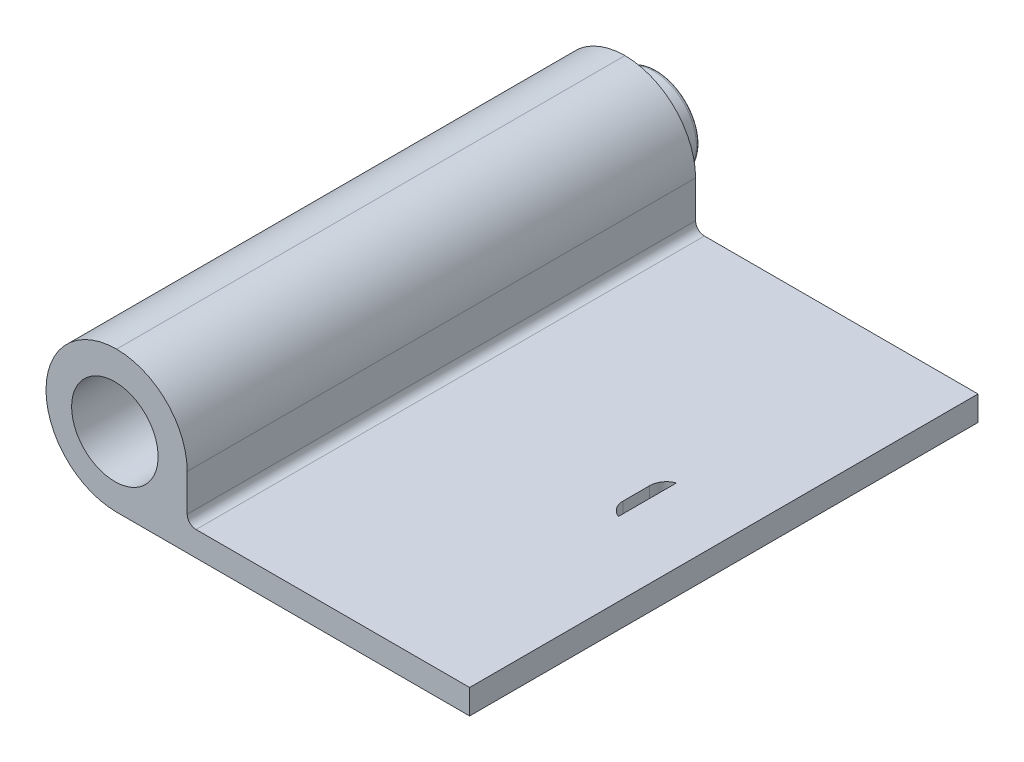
ISO-10303-21;
HEADER;
FILE_DESCRIPTION(('STEP AP214'),'2;1');
FILE_NAME('part.step','',(''),(''),'','','');
FILE_SCHEMA(('AUTOMOTIVE_DESIGN { 1 0 10303 214 1 1 1 1 }'));
ENDSEC;
DATA;
#1=APPLICATION_CONTEXT('core data for automotive mechanical design processes');
#2=APPLICATION_PROTOCOL_DEFINITION('international standard','automotive_design',2000,#1);
#3=PRODUCT_CONTEXT('',#1,'mechanical');
#4=PRODUCT('Part','Part','',(#3));
#5=PRODUCT_RELATED_PRODUCT_CATEGORY('part','',(#4));
#6=PRODUCT_DEFINITION_FORMATION('','',#4);
#7=PRODUCT_DEFINITION_CONTEXT('part definition',#1,'design');
#8=PRODUCT_DEFINITION('design','',#6,#7);
#9=PRODUCT_DEFINITION_SHAPE('','',#8);
#10=(LENGTH_UNIT() NAMED_UNIT(*) SI_UNIT(.MILLI.,.METRE.));
#11=(NAMED_UNIT(*) PLANE_ANGLE_UNIT() SI_UNIT($,.RADIAN.));
#12=(NAMED_UNIT(*) SI_UNIT($,.STERADIAN.) SOLID_ANGLE_UNIT());
#13=UNCERTAINTY_MEASURE_WITH_UNIT(LENGTH_MEASURE(1.E-05),#10,'distance_accuracy_value','');
#14=(GEOMETRIC_REPRESENTATION_CONTEXT(3) GLOBAL_UNCERTAINTY_ASSIGNED_CONTEXT((#13)) GLOBAL_UNIT_ASSIGNED_CONTEXT((#10,
#11,#12)) REPRESENTATION_CONTEXT('',''));
#15=CARTESIAN_POINT('',(0.,0.,0.));
#16=DIRECTION('',(0.,0.,1.));
#17=DIRECTION('',(1.,0.,0.));
#18=AXIS2_PLACEMENT_3D('',#15,#16,#17);
#19=CARTESIAN_POINT('',(0.,1.4,-28.8));
#20=DIRECTION('',(0.,0.,1.));
#21=DIRECTION('',(1.,0.,0.));
#22=AXIS2_PLACEMENT_3D('',#19,#20,#21);
#23=PLANE('',#22);
#24=DIRECTION('',(-1.,0.,0.));
#25=VECTOR('',#24,1.);
#26=CARTESIAN_POINT('',(0.,0.,-28.8));
#27=LINE('',#26,#25);
#28=CARTESIAN_POINT('',(24.,0.,-28.8));
#29=VERTEX_POINT('',#28);
#30=CARTESIAN_POINT('',(4.,0.,-28.8));
#31=VERTEX_POINT('',#30);
#32=EDGE_CURVE('E220',#29,#31,#27,.T.);
#33=ORIENTED_EDGE('',*,*,#32,.T.);
#34=CARTESIAN_POINT('',(4.,4.,-28.8));
#35=DIRECTION('',(0.,0.,1.));
#36=DIRECTION('',(1.,0.,0.));
#37=AXIS2_PLACEMENT_3D('',#34,#35,#36);
#38=CIRCLE('',#37,4.);
#39=CARTESIAN_POINT('',(0.,4.,-28.8));
#40=VERTEX_POINT('',#39);
#41=EDGE_CURVE('E304',#31,#40,#38,.F.);
#42=ORIENTED_EDGE('',*,*,#41,.T.);
#43=CARTESIAN_POINT('',(4.,4.,-28.8));
#44=DIRECTION('',(0.,0.,1.));
#45=DIRECTION('',(1.,0.,0.));
#46=AXIS2_PLACEMENT_3D('',#43,#44,#45);
#47=CIRCLE('',#46,4.);
#48=CARTESIAN_POINT('',(4.,8.,-28.8));
#49=VERTEX_POINT('',#48);
#50=EDGE_CURVE('E307',#40,#49,#47,.F.);
#51=ORIENTED_EDGE('',*,*,#50,.T.);
#52=CARTESIAN_POINT('',(4.,4.,-28.8));
#53=DIRECTION('',(0.,0.,1.));
#54=DIRECTION('',(1.,0.,0.));
#55=AXIS2_PLACEMENT_3D('',#52,#53,#54);
#56=CIRCLE('',#55,4.);
#57=CARTESIAN_POINT('',(8.,4.,-28.8));
#58=VERTEX_POINT('',#57);
#59=EDGE_CURVE('E322',#49,#58,#56,.F.);
#60=ORIENTED_EDGE('',*,*,#59,.T.);
#61=DIRECTION('',(0.,-1.,0.));
#62=VECTOR('',#61,1.);
#63=CARTESIAN_POINT('',(8.,8.,-28.8));
#64=LINE('',#63,#62);
#65=CARTESIAN_POINT('',(8.,1.9,-28.8));
#66=VERTEX_POINT('',#65);
#67=EDGE_CURVE('E214',#58,#66,#64,.T.);
#68=ORIENTED_EDGE('',*,*,#67,.T.);
#69=CARTESIAN_POINT('',(8.5,1.9,-28.8));
#70=DIRECTION('',(0.,0.,1.));
#71=DIRECTION('',(1.,0.,0.));
#72=AXIS2_PLACEMENT_3D('',#69,#70,#71);
#73=CIRCLE('',#72,0.5);
#74=CARTESIAN_POINT('',(8.5,1.4,-28.8));
#75=VERTEX_POINT('',#74);
#76=EDGE_CURVE('E235',#66,#75,#73,.T.);
#77=ORIENTED_EDGE('',*,*,#76,.T.);
#78=DIRECTION('',(-1.,0.,0.));
#79=VECTOR('',#78,1.);
#80=CARTESIAN_POINT('',(0.,1.4,-28.8));
#81=LINE('',#80,#79);
#82=CARTESIAN_POINT('',(24.,1.4,-28.8));
#83=VERTEX_POINT('',#82);
#84=EDGE_CURVE('E299',#83,#75,#81,.T.);
#85=ORIENTED_EDGE('',*,*,#84,.F.);
#86=DIRECTION('',(0.,-1.,0.));
#87=VECTOR('',#86,1.);
#88=CARTESIAN_POINT('',(24.,1.4,-28.8));
#89=LINE('',#88,#87);
#90=EDGE_CURVE('E290',#83,#29,#89,.T.);
#91=ORIENTED_EDGE('',*,*,#90,.T.);
#92=EDGE_LOOP('',(#33,#42,#51,#60,#68,#77,#85,#91));
#93=FACE_BOUND('',#92,.T.);
#94=CARTESIAN_POINT('',(4.,4.,-28.8));
#95=DIRECTION('',(0.,0.,1.));
#96=DIRECTION('',(1.,0.,0.));
#97=AXIS2_PLACEMENT_3D('',#94,#95,#96);
#98=CIRCLE('',#97,2.45);
#99=CARTESIAN_POINT('',(6.45,4.,-28.8));
#100=VERTEX_POINT('',#99);
#101=EDGE_CURVE('E242',#100,#100,#98,.F.);
#102=ORIENTED_EDGE('',*,*,#101,.F.);
#103=EDGE_LOOP('',(#102));
#104=FACE_BOUND('',#103,.T.);
#105=ADVANCED_FACE('F27',(#93,#104),#23,.F.);
#106=CARTESIAN_POINT('',(19.8253440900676,3.63108078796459,-12.607196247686));
#107=DIRECTION('',(-1.,0.,0.));
#108=DIRECTION('',(0.,0.,1.));
#109=AXIS2_PLACEMENT_3D('',#106,#107,#108);
#110=PLANE('',#109);
#111=DIRECTION('',(0.,-1.,0.));
#112=VECTOR('',#111,1.);
#113=CARTESIAN_POINT('',(19.8253440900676,3.63108078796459,-15.892803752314));
#114=LINE('',#113,#112);
#115=CARTESIAN_POINT('',(19.8253440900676,0.,-15.892803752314));
#116=VERTEX_POINT('',#115);
#117=CARTESIAN_POINT('',(19.8253440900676,-0.7,-15.892803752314));
#118=VERTEX_POINT('',#117);
#119=EDGE_CURVE('E204',#116,#118,#114,.T.);
#120=ORIENTED_EDGE('',*,*,#119,.T.);
#121=DIRECTION('',(0.,0.,1.));
#122=VECTOR('',#121,1.);
#123=CARTESIAN_POINT('',(19.8253440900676,-0.7,-12.607196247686));
#124=LINE('',#123,#122);
#125=CARTESIAN_POINT('',(19.8253440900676,-0.699999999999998,-12.607196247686));
#126=VERTEX_POINT('',#125);
#127=EDGE_CURVE('E239',#118,#126,#124,.T.);
#128=ORIENTED_EDGE('',*,*,#127,.T.);
#129=DIRECTION('',(0.,-1.,0.));
#130=VECTOR('',#129,1.);
#131=CARTESIAN_POINT('',(19.8253440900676,3.63108078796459,-12.607196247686));
#132=LINE('',#131,#130);
#133=CARTESIAN_POINT('',(19.8253440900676,0.,-12.607196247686));
#134=VERTEX_POINT('',#133);
#135=EDGE_CURVE('E200',#134,#126,#132,.T.);
#136=ORIENTED_EDGE('',*,*,#135,.F.);
#137=DIRECTION('',(0.,-1.,0.));
#138=VECTOR('',#137,1.);
#139=CARTESIAN_POINT('',(19.8253440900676,8.,-12.607196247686));
#140=LINE('',#139,#138);
#141=CARTESIAN_POINT('',(19.8253440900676,1.4,-12.607196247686));
#142=VERTEX_POINT('',#141);
#143=EDGE_CURVE('E523',#142,#134,#140,.T.);
#144=ORIENTED_EDGE('',*,*,#143,.F.);
#145=DIRECTION('',(0.,0.,1.));
#146=VECTOR('',#145,1.);
#147=CARTESIAN_POINT('',(19.8253440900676,1.4,-28.8));
#148=LINE('',#147,#146);
#149=CARTESIAN_POINT('',(19.8253440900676,1.4,-15.892803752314));
#150=VERTEX_POINT('',#149);
#151=EDGE_CURVE('E162',#150,#142,#148,.T.);
#152=ORIENTED_EDGE('',*,*,#151,.F.);
#153=DIRECTION('',(0.,-1.,0.));
#154=VECTOR('',#153,1.);
#155=CARTESIAN_POINT('',(19.8253440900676,8.,-15.892803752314));
#156=LINE('',#155,#154);
#157=EDGE_CURVE('E516',#150,#116,#156,.T.);
#158=ORIENTED_EDGE('',*,*,#157,.T.);
#159=EDGE_LOOP('',(#120,#128,#136,#144,#152,#158));
#160=FACE_BOUND('',#159,.T.);
#161=ADVANCED_FACE('F260',(#160),#110,.T.);
#162=CARTESIAN_POINT('',(0.,1.4,-28.8));
#163=DIRECTION('',(0.,-1.,0.));
#164=DIRECTION('',(0.,0.,-1.));
#165=AXIS2_PLACEMENT_3D('',#162,#163,#164);
#166=PLANE('',#165);
#167=ORIENTED_EDGE('',*,*,#151,.T.);
#168=CARTESIAN_POINT('',(20.15,1.4,-13.5));
#169=DIRECTION('',(0.,-1.,0.));
#170=DIRECTION('',(0.,0.,-1.));
#171=AXIS2_PLACEMENT_3D('',#168,#169,#170);
#172=CIRCLE('',#171,0.95);
#173=CARTESIAN_POINT('',(19.2,1.4,-13.5));
#174=VERTEX_POINT('',#173);
#175=EDGE_CURVE('E153',#142,#174,#172,.T.);
#176=ORIENTED_EDGE('',*,*,#175,.T.);
#177=DIRECTION('',(0.,0.,-1.));
#178=VECTOR('',#177,1.);
#179=CARTESIAN_POINT('',(19.2,1.4,-28.8));
#180=LINE('',#179,#178);
#181=CARTESIAN_POINT('',(19.2,1.4,-15.));
#182=VERTEX_POINT('',#181);
#183=EDGE_CURVE('E143',#174,#182,#180,.T.);
#184=ORIENTED_EDGE('',*,*,#183,.T.);
#185=CARTESIAN_POINT('',(20.15,1.4,-15.));
#186=DIRECTION('',(0.,-1.,0.));
#187=DIRECTION('',(0.,0.,-1.));
#188=AXIS2_PLACEMENT_3D('',#185,#186,#187);
#189=CIRCLE('',#188,0.949999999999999);
#190=EDGE_CURVE('E515',#182,#150,#189,.T.);
#191=ORIENTED_EDGE('',*,*,#190,.T.);
#192=EDGE_LOOP('',(#167,#176,#184,#191));
#193=FACE_BOUND('',#192,.T.);
#194=ORIENTED_EDGE('',*,*,#84,.T.);
#195=DIRECTION('',(0.,0.,-1.));
#196=VECTOR('',#195,1.);
#197=CARTESIAN_POINT('',(8.5,1.4,0.));
#198=LINE('',#197,#196);
#199=CARTESIAN_POINT('',(8.5,1.4,0.));
#200=VERTEX_POINT('',#199);
#201=EDGE_CURVE('E233',#75,#200,#198,.F.);
#202=ORIENTED_EDGE('',*,*,#201,.T.);
#203=DIRECTION('',(1.,0.,0.));
#204=VECTOR('',#203,1.);
#205=CARTESIAN_POINT('',(0.,1.4,0.));
#206=LINE('',#205,#204);
#207=CARTESIAN_POINT('',(24.,1.4,0.));
#208=VERTEX_POINT('',#207);
#209=EDGE_CURVE('E223',#200,#208,#206,.T.);
#210=ORIENTED_EDGE('',*,*,#209,.T.);
#211=DIRECTION('',(0.,0.,-1.));
#212=VECTOR('',#211,1.);
#213=CARTESIAN_POINT('',(24.,1.4,0.));
#214=LINE('',#213,#212);
#215=EDGE_CURVE('E226',#208,#83,#214,.T.);
#216=ORIENTED_EDGE('',*,*,#215,.T.);
#217=EDGE_LOOP('',(#194,#202,#210,#216));
#218=FACE_BOUND('',#217,.T.);
#219=ADVANCED_FACE('F160',(#193,#218),#166,.F.);
#220=CARTESIAN_POINT('',(0.,1.4,0.));
#221=DIRECTION('',(0.,0.,-1.));
#222=DIRECTION('',(-1.,0.,0.));
#223=AXIS2_PLACEMENT_3D('',#220,#221,#222);
#224=PLANE('',#223);
#225=CARTESIAN_POINT('',(3.9,3.9,0.));
#226=DIRECTION('',(0.,0.,-1.));
#227=DIRECTION('',(-1.,0.,0.));
#228=AXIS2_PLACEMENT_3D('',#225,#226,#227);
#229=CIRCLE('',#228,2.45);
#230=CARTESIAN_POINT('',(1.45,3.9,0.));
#231=VERTEX_POINT('',#230);
#232=EDGE_CURVE('E211',#231,#231,#229,.T.);
#233=ORIENTED_EDGE('',*,*,#232,.T.);
#234=EDGE_LOOP('',(#233));
#235=FACE_BOUND('',#234,.T.);
#236=CARTESIAN_POINT('',(4.,4.,0.));
#237=DIRECTION('',(0.,0.,-1.));
#238=DIRECTION('',(-1.,0.,0.));
#239=AXIS2_PLACEMENT_3D('',#236,#237,#238);
#240=CIRCLE('',#239,4.);
#241=CARTESIAN_POINT('',(4.,8.,0.));
#242=VERTEX_POINT('',#241);
#243=CARTESIAN_POINT('',(0.,4.,0.));
#244=VERTEX_POINT('',#243);
#245=EDGE_CURVE('E314',#242,#244,#240,.F.);
#246=ORIENTED_EDGE('',*,*,#245,.T.);
#247=CARTESIAN_POINT('',(4.,4.,0.));
#248=DIRECTION('',(0.,0.,-1.));
#249=DIRECTION('',(-1.,0.,0.));
#250=AXIS2_PLACEMENT_3D('',#247,#248,#249);
#251=CIRCLE('',#250,4.);
#252=CARTESIAN_POINT('',(4.,0.,0.));
#253=VERTEX_POINT('',#252);
#254=EDGE_CURVE('E305',#244,#253,#251,.F.);
#255=ORIENTED_EDGE('',*,*,#254,.T.);
#256=DIRECTION('',(1.,0.,0.));
#257=VECTOR('',#256,1.);
#258=CARTESIAN_POINT('',(0.,0.,0.));
#259=LINE('',#258,#257);
#260=CARTESIAN_POINT('',(24.,0.,0.));
#261=VERTEX_POINT('',#260);
#262=EDGE_CURVE('E215',#253,#261,#259,.T.);
#263=ORIENTED_EDGE('',*,*,#262,.T.);
#264=DIRECTION('',(0.,-1.,0.));
#265=VECTOR('',#264,1.);
#266=CARTESIAN_POINT('',(24.,1.4,0.));
#267=LINE('',#266,#265);
#268=EDGE_CURVE('E293',#208,#261,#267,.T.);
#269=ORIENTED_EDGE('',*,*,#268,.F.);
#270=ORIENTED_EDGE('',*,*,#209,.F.);
#271=CARTESIAN_POINT('',(8.5,1.9,0.));
#272=DIRECTION('',(0.,0.,-1.));
#273=DIRECTION('',(-1.,0.,0.));
#274=AXIS2_PLACEMENT_3D('',#271,#272,#273);
#275=CIRCLE('',#274,0.5);
#276=CARTESIAN_POINT('',(8.,1.9,0.));
#277=VERTEX_POINT('',#276);
#278=EDGE_CURVE('E237',#200,#277,#275,.T.);
#279=ORIENTED_EDGE('',*,*,#278,.T.);
#280=DIRECTION('',(0.,-1.,0.));
#281=VECTOR('',#280,1.);
#282=CARTESIAN_POINT('',(8.,8.,0.));
#283=LINE('',#282,#281);
#284=CARTESIAN_POINT('',(8.,4.,0.));
#285=VERTEX_POINT('',#284);
#286=EDGE_CURVE('E218',#285,#277,#283,.T.);
#287=ORIENTED_EDGE('',*,*,#286,.F.);
#288=CARTESIAN_POINT('',(4.,4.,0.));
#289=DIRECTION('',(0.,0.,-1.));
#290=DIRECTION('',(-1.,0.,0.));
#291=AXIS2_PLACEMENT_3D('',#288,#289,#290);
#292=CIRCLE('',#291,4.);
#293=EDGE_CURVE('E317',#285,#242,#292,.F.);
#294=ORIENTED_EDGE('',*,*,#293,.T.);
#295=EDGE_LOOP('',(#246,#255,#263,#269,#270,#279,#287,#294));
#296=FACE_BOUND('',#295,.T.);
#297=ADVANCED_FACE('F29',(#235,#296),#224,.F.);
#298=CARTESIAN_POINT('',(24.,1.4,0.));
#299=DIRECTION('',(-1.,0.,0.));
#300=DIRECTION('',(0.,0.,1.));
#301=AXIS2_PLACEMENT_3D('',#298,#299,#300);
#302=PLANE('',#301);
#303=DIRECTION('',(0.,0.,-1.));
#304=VECTOR('',#303,1.);
#305=CARTESIAN_POINT('',(24.,0.,0.));
#306=LINE('',#305,#304);
#307=EDGE_CURVE('E217',#261,#29,#306,.T.);
#308=ORIENTED_EDGE('',*,*,#307,.T.);
#309=ORIENTED_EDGE('',*,*,#90,.F.);
#310=ORIENTED_EDGE('',*,*,#215,.F.);
#311=ORIENTED_EDGE('',*,*,#268,.T.);
#312=EDGE_LOOP('',(#308,#309,#310,#311));
#313=FACE_BOUND('',#312,.T.);
#314=ADVANCED_FACE('F273',(#313),#302,.F.);
#315=CARTESIAN_POINT('',(0.,0.,-28.8));
#316=DIRECTION('',(0.,-1.,0.));
#317=DIRECTION('',(0.,0.,-1.));
#318=AXIS2_PLACEMENT_3D('',#315,#316,#317);
#319=PLANE('',#318);
#320=CARTESIAN_POINT('',(20.15,0.,-13.5));
#321=DIRECTION('',(0.,-1.,0.));
#322=DIRECTION('',(0.,0.,-1.));
#323=AXIS2_PLACEMENT_3D('',#320,#321,#322);
#324=CIRCLE('',#323,0.95);
#325=CARTESIAN_POINT('',(19.2,0.,-13.5));
#326=VERTEX_POINT('',#325);
#327=EDGE_CURVE('E156',#134,#326,#324,.T.);
#328=ORIENTED_EDGE('',*,*,#327,.F.);
#329=CARTESIAN_POINT('',(20.15,0.,-13.5));
#330=DIRECTION('',(0.,-1.,0.));
#331=DIRECTION('',(0.,0.,-1.));
#332=AXIS2_PLACEMENT_3D('',#329,#330,#331);
#333=CIRCLE('',#332,0.95);
#334=CARTESIAN_POINT('',(21.1,0.,-13.5));
#335=VERTEX_POINT('',#334);
#336=EDGE_CURVE('E190',#134,#335,#333,.F.);
#337=ORIENTED_EDGE('',*,*,#336,.T.);
#338=DIRECTION('',(0.,0.,-1.));
#339=VECTOR('',#338,1.);
#340=CARTESIAN_POINT('',(21.1,0.,-13.5));
#341=LINE('',#340,#339);
#342=CARTESIAN_POINT('',(21.1,0.,-15.));
#343=VERTEX_POINT('',#342);
#344=EDGE_CURVE('E187',#335,#343,#341,.T.);
#345=ORIENTED_EDGE('',*,*,#344,.T.);
#346=CARTESIAN_POINT('',(20.15,0.,-15.));
#347=DIRECTION('',(0.,-1.,0.));
#348=DIRECTION('',(0.,0.,-1.));
#349=AXIS2_PLACEMENT_3D('',#346,#347,#348);
#350=CIRCLE('',#349,0.95);
#351=EDGE_CURVE('E184',#343,#116,#350,.F.);
#352=ORIENTED_EDGE('',*,*,#351,.T.);
#353=CARTESIAN_POINT('',(20.15,0.,-15.));
#354=DIRECTION('',(0.,-1.,0.));
#355=DIRECTION('',(0.,0.,-1.));
#356=AXIS2_PLACEMENT_3D('',#353,#354,#355);
#357=CIRCLE('',#356,0.949999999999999);
#358=CARTESIAN_POINT('',(19.2,0.,-15.));
#359=VERTEX_POINT('',#358);
#360=EDGE_CURVE('E148',#359,#116,#357,.T.);
#361=ORIENTED_EDGE('',*,*,#360,.F.);
#362=DIRECTION('',(0.,0.,-1.));
#363=VECTOR('',#362,1.);
#364=CARTESIAN_POINT('',(19.2,0.,-28.8));
#365=LINE('',#364,#363);
#366=EDGE_CURVE('E149',#326,#359,#365,.T.);
#367=ORIENTED_EDGE('',*,*,#366,.F.);
#368=EDGE_LOOP('',(#328,#337,#345,#352,#361,#367));
#369=FACE_BOUND('',#368,.T.);
#370=ORIENTED_EDGE('',*,*,#262,.F.);
#371=DIRECTION('',(0.,0.,1.));
#372=VECTOR('',#371,1.);
#373=CARTESIAN_POINT('',(4.,0.,-28.8));
#374=LINE('',#373,#372);
#375=EDGE_CURVE('E302',#253,#31,#374,.F.);
#376=ORIENTED_EDGE('',*,*,#375,.T.);
#377=ORIENTED_EDGE('',*,*,#32,.F.);
#378=ORIENTED_EDGE('',*,*,#307,.F.);
#379=EDGE_LOOP('',(#370,#376,#377,#378));
#380=FACE_BOUND('',#379,.T.);
#381=ADVANCED_FACE('F275',(#369,#380),#319,.T.);
#382=CARTESIAN_POINT('',(8.,8.,-28.8));
#383=DIRECTION('',(-1.,0.,0.));
#384=DIRECTION('',(0.,0.,1.));
#385=AXIS2_PLACEMENT_3D('',#382,#383,#384);
#386=PLANE('',#385);
#387=ORIENTED_EDGE('',*,*,#286,.T.);
#388=DIRECTION('',(0.,0.,-1.));
#389=VECTOR('',#388,1.);
#390=CARTESIAN_POINT('',(8.,1.9,-28.8));
#391=LINE('',#390,#389);
#392=EDGE_CURVE('E231',#277,#66,#391,.T.);
#393=ORIENTED_EDGE('',*,*,#392,.T.);
#394=ORIENTED_EDGE('',*,*,#67,.F.);
#395=DIRECTION('',(0.,0.,-1.));
#396=VECTOR('',#395,1.);
#397=CARTESIAN_POINT('',(8.,4.,0.));
#398=LINE('',#397,#396);
#399=EDGE_CURVE('E320',#58,#285,#398,.F.);
#400=ORIENTED_EDGE('',*,*,#399,.T.);
#401=EDGE_LOOP('',(#387,#393,#394,#400));
#402=FACE_BOUND('',#401,.T.);
#403=ADVANCED_FACE('F281',(#402),#386,.F.);
#404=CARTESIAN_POINT('',(4.,4.,0.));
#405=DIRECTION('',(0.,0.,1.));
#406=DIRECTION('',(1.,0.,0.));
#407=AXIS2_PLACEMENT_3D('',#404,#405,#406);
#408=CYLINDRICAL_SURFACE('',#407,4.);
#409=ORIENTED_EDGE('',*,*,#293,.F.);
#410=ORIENTED_EDGE('',*,*,#399,.F.);
#411=ORIENTED_EDGE('',*,*,#59,.F.);
#412=DIRECTION('',(0.,0.,-1.));
#413=VECTOR('',#412,1.);
#414=CARTESIAN_POINT('',(4.,8.,-28.8));
#415=LINE('',#414,#413);
#416=EDGE_CURVE('E332',#242,#49,#415,.T.);
#417=ORIENTED_EDGE('',*,*,#416,.F.);
#418=EDGE_LOOP('',(#409,#410,#411,#417));
#419=FACE_BOUND('',#418,.T.);
#420=ADVANCED_FACE('F344',(#419),#408,.T.);
#421=CARTESIAN_POINT('',(4.,4.,0.));
#422=DIRECTION('',(0.,0.,-1.));
#423=DIRECTION('',(-1.,0.,0.));
#424=AXIS2_PLACEMENT_3D('',#421,#422,#423);
#425=CYLINDRICAL_SURFACE('',#424,4.);
#426=ORIENTED_EDGE('',*,*,#50,.F.);
#427=DIRECTION('',(0.,0.,1.));
#428=VECTOR('',#427,1.);
#429=CARTESIAN_POINT('',(0.,4.,-28.8));
#430=LINE('',#429,#428);
#431=EDGE_CURVE('E311',#244,#40,#430,.F.);
#432=ORIENTED_EDGE('',*,*,#431,.F.);
#433=ORIENTED_EDGE('',*,*,#245,.F.);
#434=ORIENTED_EDGE('',*,*,#416,.T.);
#435=EDGE_LOOP('',(#426,#432,#433,#434));
#436=FACE_BOUND('',#435,.T.);
#437=ADVANCED_FACE('F358',(#436),#425,.T.);
#438=CARTESIAN_POINT('',(4.,4.,0.));
#439=DIRECTION('',(0.,0.,-1.));
#440=DIRECTION('',(-1.,0.,0.));
#441=AXIS2_PLACEMENT_3D('',#438,#439,#440);
#442=CYLINDRICAL_SURFACE('',#441,4.);
#443=ORIENTED_EDGE('',*,*,#41,.F.);
#444=ORIENTED_EDGE('',*,*,#375,.F.);
#445=ORIENTED_EDGE('',*,*,#254,.F.);
#446=ORIENTED_EDGE('',*,*,#431,.T.);
#447=EDGE_LOOP('',(#443,#444,#445,#446));
#448=FACE_BOUND('',#447,.T.);
#449=ADVANCED_FACE('F355',(#448),#442,.T.);
#450=CARTESIAN_POINT('',(3.9,3.9,0.));
#451=DIRECTION('',(0.,0.,-1.));
#452=DIRECTION('',(-1.,0.,0.));
#453=AXIS2_PLACEMENT_3D('',#450,#451,#452);
#454=CYLINDRICAL_SURFACE('',#453,2.45);
#455=ORIENTED_EDGE('',*,*,#232,.F.);
#456=EDGE_LOOP('',(#455));
#457=FACE_BOUND('',#456,.T.);
#458=CARTESIAN_POINT('',(3.9,3.9,-27.7));
#459=DIRECTION('',(0.,0.,-1.));
#460=DIRECTION('',(-1.,0.,0.));
#461=AXIS2_PLACEMENT_3D('',#458,#459,#460);
#462=CIRCLE('',#461,2.45);
#463=CARTESIAN_POINT('',(1.45,3.9,-27.7));
#464=VERTEX_POINT('',#463);
#465=EDGE_CURVE('E192',#464,#464,#462,.T.);
#466=ORIENTED_EDGE('',*,*,#465,.T.);
#467=EDGE_LOOP('',(#466));
#468=FACE_BOUND('',#467,.T.);
#469=ADVANCED_FACE('F364',(#457,#468),#454,.F.);
#470=CARTESIAN_POINT('',(3.9,3.9,-27.7));
#471=DIRECTION('',(0.,0.,-1.));
#472=DIRECTION('',(-1.,0.,0.));
#473=AXIS2_PLACEMENT_3D('',#470,#471,#472);
#474=PLANE('',#473);
#475=ORIENTED_EDGE('',*,*,#465,.F.);
#476=EDGE_LOOP('',(#475));
#477=FACE_BOUND('',#476,.T.);
#478=ADVANCED_FACE('F383',(#477),#474,.F.);
#479=CARTESIAN_POINT('',(8.5,1.9,-28.8));
#480=DIRECTION('',(0.,0.,1.));
#481=DIRECTION('',(1.,0.,0.));
#482=AXIS2_PLACEMENT_3D('',#479,#480,#481);
#483=CYLINDRICAL_SURFACE('',#482,0.5);
#484=ORIENTED_EDGE('',*,*,#278,.F.);
#485=ORIENTED_EDGE('',*,*,#201,.F.);
#486=ORIENTED_EDGE('',*,*,#76,.F.);
#487=ORIENTED_EDGE('',*,*,#392,.F.);
#488=EDGE_LOOP('',(#484,#485,#486,#487));
#489=FACE_BOUND('',#488,.T.);
#490=ADVANCED_FACE('F351',(#489),#483,.F.);
#491=CARTESIAN_POINT('',(20.15,3.63108078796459,-13.5));
#492=DIRECTION('',(0.,-1.,0.));
#493=DIRECTION('',(0.,0.,-1.));
#494=AXIS2_PLACEMENT_3D('',#491,#492,#493);
#495=CYLINDRICAL_SURFACE('',#494,0.95);
#496=CARTESIAN_POINT('',(20.15,-1.8,-13.5));
#497=DIRECTION('',(0.,-1.,0.));
#498=DIRECTION('',(0.,0.,-1.));
#499=AXIS2_PLACEMENT_3D('',#496,#497,#498);
#500=CIRCLE('',#499,0.95);
#501=CARTESIAN_POINT('',(21.1,-1.8,-13.5));
#502=VERTEX_POINT('',#501);
#503=CARTESIAN_POINT('',(19.2,-1.8,-13.5));
#504=VERTEX_POINT('',#503);
#505=EDGE_CURVE('E183',#502,#504,#500,.T.);
#506=ORIENTED_EDGE('',*,*,#505,.F.);
#507=DIRECTION('',(0.,-1.,0.));
#508=VECTOR('',#507,1.);
#509=CARTESIAN_POINT('',(21.1,3.63108078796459,-13.5));
#510=LINE('',#509,#508);
#511=EDGE_CURVE('E188',#335,#502,#510,.T.);
#512=ORIENTED_EDGE('',*,*,#511,.F.);
#513=ORIENTED_EDGE('',*,*,#336,.F.);
#514=ORIENTED_EDGE('',*,*,#135,.T.);
#515=CARTESIAN_POINT('',(20.15,-0.7,-13.5));
#516=DIRECTION('',(0.,-1.,0.));
#517=DIRECTION('',(0.,0.,-1.));
#518=AXIS2_PLACEMENT_3D('',#515,#516,#517);
#519=CIRCLE('',#518,0.95);
#520=CARTESIAN_POINT('',(19.2,-0.7,-13.5));
#521=VERTEX_POINT('',#520);
#522=EDGE_CURVE('E163',#126,#521,#519,.T.);
#523=ORIENTED_EDGE('',*,*,#522,.T.);
#524=DIRECTION('',(0.,1.,0.));
#525=VECTOR('',#524,1.);
#526=CARTESIAN_POINT('',(19.2,-1.8,-13.5));
#527=LINE('',#526,#525);
#528=EDGE_CURVE('E180',#504,#521,#527,.T.);
#529=ORIENTED_EDGE('',*,*,#528,.F.);
#530=EDGE_LOOP('',(#506,#512,#513,#514,#523,#529));
#531=FACE_BOUND('',#530,.T.);
#532=ADVANCED_FACE('F382',(#531),#495,.T.);
#533=CARTESIAN_POINT('',(21.1,3.63108078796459,-13.5));
#534=DIRECTION('',(1.,0.,0.));
#535=DIRECTION('',(0.,0.,-1.));
#536=AXIS2_PLACEMENT_3D('',#533,#534,#535);
#537=PLANE('',#536);
#538=DIRECTION('',(0.,0.,1.));
#539=VECTOR('',#538,1.);
#540=CARTESIAN_POINT('',(21.1,-1.8,-13.5));
#541=LINE('',#540,#539);
#542=CARTESIAN_POINT('',(21.1,-1.8,-15.));
#543=VERTEX_POINT('',#542);
#544=EDGE_CURVE('E197',#543,#502,#541,.T.);
#545=ORIENTED_EDGE('',*,*,#544,.F.);
#546=DIRECTION('',(0.,-1.,0.));
#547=VECTOR('',#546,1.);
#548=CARTESIAN_POINT('',(21.1,3.63108078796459,-15.));
#549=LINE('',#548,#547);
#550=EDGE_CURVE('E202',#343,#543,#549,.T.);
#551=ORIENTED_EDGE('',*,*,#550,.F.);
#552=ORIENTED_EDGE('',*,*,#344,.F.);
#553=ORIENTED_EDGE('',*,*,#511,.T.);
#554=EDGE_LOOP('',(#545,#551,#552,#553));
#555=FACE_BOUND('',#554,.T.);
#556=ADVANCED_FACE('F389',(#555),#537,.T.);
#557=CARTESIAN_POINT('',(20.15,3.63108078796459,-15.));
#558=DIRECTION('',(0.,-1.,0.));
#559=DIRECTION('',(0.,0.,-1.));
#560=AXIS2_PLACEMENT_3D('',#557,#558,#559);
#561=CYLINDRICAL_SURFACE('',#560,0.95);
#562=CARTESIAN_POINT('',(20.15,-0.7,-15.));
#563=DIRECTION('',(0.,-1.,0.));
#564=DIRECTION('',(0.,0.,-1.));
#565=AXIS2_PLACEMENT_3D('',#562,#563,#564);
#566=CIRCLE('',#565,0.95);
#567=CARTESIAN_POINT('',(19.2,-0.7,-15.));
#568=VERTEX_POINT('',#567);
#569=EDGE_CURVE('E171',#568,#118,#566,.T.);
#570=ORIENTED_EDGE('',*,*,#569,.T.);
#571=ORIENTED_EDGE('',*,*,#119,.F.);
#572=ORIENTED_EDGE('',*,*,#351,.F.);
#573=ORIENTED_EDGE('',*,*,#550,.T.);
#574=CARTESIAN_POINT('',(20.15,-1.8,-15.));
#575=DIRECTION('',(0.,-1.,0.));
#576=DIRECTION('',(0.,0.,1.));
#577=AXIS2_PLACEMENT_3D('',#574,#575,#576);
#578=CIRCLE('',#577,0.95);
#579=CARTESIAN_POINT('',(19.2,-1.8,-15.));
#580=VERTEX_POINT('',#579);
#581=EDGE_CURVE('E194',#580,#543,#578,.T.);
#582=ORIENTED_EDGE('',*,*,#581,.F.);
#583=DIRECTION('',(0.,1.,0.));
#584=VECTOR('',#583,1.);
#585=CARTESIAN_POINT('',(19.2,-1.8,-15.));
#586=LINE('',#585,#584);
#587=EDGE_CURVE('E177',#580,#568,#586,.T.);
#588=ORIENTED_EDGE('',*,*,#587,.T.);
#589=EDGE_LOOP('',(#570,#571,#572,#573,#582,#588));
#590=FACE_BOUND('',#589,.T.);
#591=ADVANCED_FACE('F393',(#590),#561,.T.);
#592=CARTESIAN_POINT('',(20.15,-1.8,-13.5));
#593=DIRECTION('',(0.,-1.,0.));
#594=DIRECTION('',(0.,0.,-1.));
#595=AXIS2_PLACEMENT_3D('',#592,#593,#594);
#596=PLANE('',#595);
#597=ORIENTED_EDGE('',*,*,#505,.T.);
#598=DIRECTION('',(0.,0.,-1.));
#599=VECTOR('',#598,1.);
#600=CARTESIAN_POINT('',(19.2,-1.8,-13.5));
#601=LINE('',#600,#599);
#602=EDGE_CURVE('E174',#504,#580,#601,.T.);
#603=ORIENTED_EDGE('',*,*,#602,.T.);
#604=ORIENTED_EDGE('',*,*,#581,.T.);
#605=ORIENTED_EDGE('',*,*,#544,.T.);
#606=EDGE_LOOP('',(#597,#603,#604,#605));
#607=FACE_BOUND('',#606,.T.);
#608=ADVANCED_FACE('F400',(#607),#596,.T.);
#609=CARTESIAN_POINT('',(19.2,-1.8,-13.5));
#610=DIRECTION('',(1.,0.,0.));
#611=DIRECTION('',(0.,0.,-1.));
#612=AXIS2_PLACEMENT_3D('',#609,#610,#611);
#613=PLANE('',#612);
#614=DIRECTION('',(0.,0.,-1.));
#615=VECTOR('',#614,1.);
#616=CARTESIAN_POINT('',(19.2,-0.7,-13.5));
#617=LINE('',#616,#615);
#618=EDGE_CURVE('E165',#521,#568,#617,.T.);
#619=ORIENTED_EDGE('',*,*,#618,.T.);
#620=ORIENTED_EDGE('',*,*,#587,.F.);
#621=ORIENTED_EDGE('',*,*,#602,.F.);
#622=ORIENTED_EDGE('',*,*,#528,.T.);
#623=EDGE_LOOP('',(#619,#620,#621,#622));
#624=FACE_BOUND('',#623,.T.);
#625=ADVANCED_FACE('F404',(#624),#613,.F.);
#626=CARTESIAN_POINT('',(20.15,-0.7,-13.5));
#627=DIRECTION('',(0.,-1.,0.));
#628=DIRECTION('',(0.,0.,-1.));
#629=AXIS2_PLACEMENT_3D('',#626,#627,#628);
#630=PLANE('',#629);
#631=ORIENTED_EDGE('',*,*,#127,.F.);
#632=ORIENTED_EDGE('',*,*,#569,.F.);
#633=ORIENTED_EDGE('',*,*,#618,.F.);
#634=ORIENTED_EDGE('',*,*,#522,.F.);
#635=EDGE_LOOP('',(#631,#632,#633,#634));
#636=FACE_BOUND('',#635,.T.);
#637=ADVANCED_FACE('F413',(#636),#630,.F.);
#638=CARTESIAN_POINT('',(20.15,8.,-13.5));
#639=DIRECTION('',(0.,-1.,0.));
#640=DIRECTION('',(0.,0.,-1.));
#641=AXIS2_PLACEMENT_3D('',#638,#639,#640);
#642=CYLINDRICAL_SURFACE('',#641,0.95);
#643=ORIENTED_EDGE('',*,*,#143,.T.);
#644=ORIENTED_EDGE('',*,*,#327,.T.);
#645=DIRECTION('',(0.,-1.,0.));
#646=VECTOR('',#645,1.);
#647=CARTESIAN_POINT('',(19.2,8.,-13.5));
#648=LINE('',#647,#646);
#649=EDGE_CURVE('E47',#174,#326,#648,.T.);
#650=ORIENTED_EDGE('',*,*,#649,.F.);
#651=ORIENTED_EDGE('',*,*,#175,.F.);
#652=EDGE_LOOP('',(#643,#644,#650,#651));
#653=FACE_BOUND('',#652,.T.);
#654=ADVANCED_FACE('F152',(#653),#642,.F.);
#655=CARTESIAN_POINT('',(20.15,8.,-15.));
#656=DIRECTION('',(0.,-1.,0.));
#657=DIRECTION('',(0.,0.,-1.));
#658=AXIS2_PLACEMENT_3D('',#655,#656,#657);
#659=CYLINDRICAL_SURFACE('',#658,0.949999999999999);
#660=DIRECTION('',(0.,-1.,0.));
#661=VECTOR('',#660,1.);
#662=CARTESIAN_POINT('',(19.2,8.,-15.));
#663=LINE('',#662,#661);
#664=EDGE_CURVE('E42',#182,#359,#663,.T.);
#665=ORIENTED_EDGE('',*,*,#664,.T.);
#666=ORIENTED_EDGE('',*,*,#360,.T.);
#667=ORIENTED_EDGE('',*,*,#157,.F.);
#668=ORIENTED_EDGE('',*,*,#190,.F.);
#669=EDGE_LOOP('',(#665,#666,#667,#668));
#670=FACE_BOUND('',#669,.T.);
#671=ADVANCED_FACE('F455',(#670),#659,.F.);
#672=CARTESIAN_POINT('',(19.2,8.,-13.5));
#673=DIRECTION('',(-1.,0.,0.));
#674=DIRECTION('',(0.,0.,1.));
#675=AXIS2_PLACEMENT_3D('',#672,#673,#674);
#676=PLANE('',#675);
#677=ORIENTED_EDGE('',*,*,#649,.T.);
#678=ORIENTED_EDGE('',*,*,#366,.T.);
#679=ORIENTED_EDGE('',*,*,#664,.F.);
#680=ORIENTED_EDGE('',*,*,#183,.F.);
#681=EDGE_LOOP('',(#677,#678,#679,#680));
#682=FACE_BOUND('',#681,.T.);
#683=ADVANCED_FACE('F144',(#682),#676,.F.);
#684=CARTESIAN_POINT('',(4.,4.,-30.6));
#685=DIRECTION('',(0.,0.,1.));
#686=DIRECTION('',(1.,0.,0.));
#687=AXIS2_PLACEMENT_3D('',#684,#685,#686);
#688=CYLINDRICAL_SURFACE('',#687,2.45);
#689=CARTESIAN_POINT('',(4.,4.,-30.4));
#690=DIRECTION('',(0.,0.,-1.));
#691=DIRECTION('',(-1.,0.,0.));
#692=AXIS2_PLACEMENT_3D('',#689,#690,#691);
#693=CIRCLE('',#692,2.45);
#694=CARTESIAN_POINT('',(1.55,4.,-30.4));
#695=VERTEX_POINT('',#694);
#696=EDGE_CURVE('E11',#695,#695,#693,.F.);
#697=ORIENTED_EDGE('',*,*,#696,.T.);
#698=EDGE_LOOP('',(#697));
#699=FACE_BOUND('',#698,.T.);
#700=ORIENTED_EDGE('',*,*,#101,.T.);
#701=EDGE_LOOP('',(#700));
#702=FACE_BOUND('',#701,.T.);
#703=ADVANCED_FACE('F256',(#699,#702),#688,.T.);
#704=CARTESIAN_POINT('',(4.,4.,-30.6));
#705=DIRECTION('',(0.,0.,-1.));
#706=DIRECTION('',(-1.,0.,0.));
#707=AXIS2_PLACEMENT_3D('',#704,#705,#706);
#708=PLANE('',#707);
#709=CARTESIAN_POINT('',(4.,4.,-30.6));
#710=DIRECTION('',(0.,0.,-1.));
#711=DIRECTION('',(-1.,0.,0.));
#712=AXIS2_PLACEMENT_3D('',#709,#710,#711);
#713=CIRCLE('',#712,2.25);
#714=CARTESIAN_POINT('',(1.75,4.,-30.6));
#715=VERTEX_POINT('',#714);
#716=EDGE_CURVE('E35',#715,#715,#713,.T.);
#717=ORIENTED_EDGE('',*,*,#716,.T.);
#718=EDGE_LOOP('',(#717));
#719=FACE_BOUND('',#718,.T.);
#720=ADVANCED_FACE('F247',(#719),#708,.T.);
#721=CARTESIAN_POINT('',(4.,4.,-30.4));
#722=DIRECTION('',(0.,0.,-1.));
#723=DIRECTION('',(-1.,0.,0.));
#724=AXIS2_PLACEMENT_3D('',#721,#722,#723);
#725=TOROIDAL_SURFACE('',#724,2.25,0.2);
#726=ORIENTED_EDGE('',*,*,#696,.F.);
#727=EDGE_LOOP('',(#726));
#728=FACE_BOUND('',#727,.T.);
#729=ORIENTED_EDGE('',*,*,#716,.F.);
#730=EDGE_LOOP('',(#729));
#731=FACE_BOUND('',#730,.T.);
#732=ADVANCED_FACE('F249',(#728,#731),#725,.T.);
#733=CLOSED_SHELL('',(#105,#161,#219,#297,#314,#381,#403,#420,#437,#449,#469,#478,#490,#532,
#556,#591,#608,#625,#637,#654,#671,#683,#703,#720,#732));
#734=MANIFOLD_SOLID_BREP('B2',#733);
#735=ADVANCED_BREP_SHAPE_REPRESENTATION('',(#18,#734),#14);
#736=SHAPE_DEFINITION_REPRESENTATION(#9,#735);
ENDSEC;
END-ISO-10303-21;
